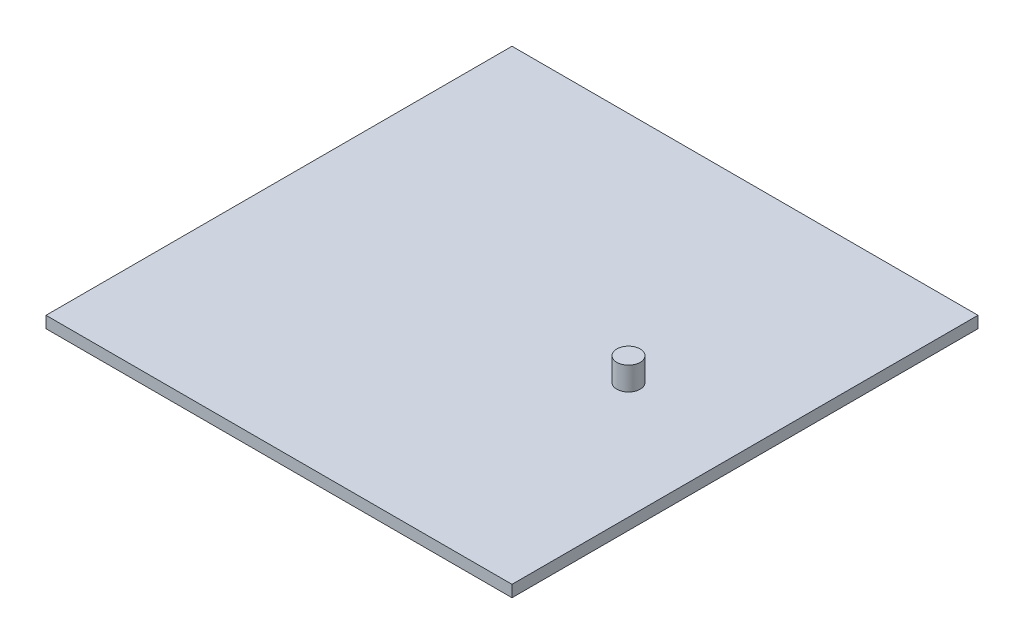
ISO-10303-21;
HEADER;
FILE_DESCRIPTION(('STEP AP214'),'2;1');
FILE_NAME('part.step','',(''),(''),'','','');
FILE_SCHEMA(('AUTOMOTIVE_DESIGN { 1 0 10303 214 1 1 1 1 }'));
ENDSEC;
DATA;
#1=APPLICATION_CONTEXT('core data for automotive mechanical design processes');
#2=APPLICATION_PROTOCOL_DEFINITION('international standard','automotive_design',2000,#1);
#3=PRODUCT_CONTEXT('',#1,'mechanical');
#4=PRODUCT('Part','Part','',(#3));
#5=PRODUCT_RELATED_PRODUCT_CATEGORY('part','',(#4));
#6=PRODUCT_DEFINITION_FORMATION('','',#4);
#7=PRODUCT_DEFINITION_CONTEXT('part definition',#1,'design');
#8=PRODUCT_DEFINITION('design','',#6,#7);
#9=PRODUCT_DEFINITION_SHAPE('','',#8);
#10=(LENGTH_UNIT() NAMED_UNIT(*) SI_UNIT(.MILLI.,.METRE.));
#11=(NAMED_UNIT(*) PLANE_ANGLE_UNIT() SI_UNIT($,.RADIAN.));
#12=(NAMED_UNIT(*) SI_UNIT($,.STERADIAN.) SOLID_ANGLE_UNIT());
#13=UNCERTAINTY_MEASURE_WITH_UNIT(LENGTH_MEASURE(1.E-05),#10,'distance_accuracy_value','');
#14=(GEOMETRIC_REPRESENTATION_CONTEXT(3) GLOBAL_UNCERTAINTY_ASSIGNED_CONTEXT((#13)) GLOBAL_UNIT_ASSIGNED_CONTEXT((#10,
#11,#12)) REPRESENTATION_CONTEXT('',''));
#15=CARTESIAN_POINT('',(0.,0.,0.));
#16=DIRECTION('',(0.,0.,1.));
#17=DIRECTION('',(1.,0.,0.));
#18=AXIS2_PLACEMENT_3D('',#15,#16,#17);
#19=CARTESIAN_POINT('',(0.,5.,0.));
#20=DIRECTION('',(0.,-1.,0.));
#21=DIRECTION('',(0.,0.,-1.));
#22=AXIS2_PLACEMENT_3D('',#19,#20,#21);
#23=PLANE('',#22);
#24=DIRECTION('',(0.,0.,1.));
#25=VECTOR('',#24,1.);
#26=CARTESIAN_POINT('',(0.,5.,0.));
#27=LINE('',#26,#25);
#28=CARTESIAN_POINT('',(0.,5.,-200.));
#29=VERTEX_POINT('',#28);
#30=CARTESIAN_POINT('',(0.,5.,0.));
#31=VERTEX_POINT('',#30);
#32=EDGE_CURVE('E86',#29,#31,#27,.T.);
#33=ORIENTED_EDGE('',*,*,#32,.T.);
#34=DIRECTION('',(1.,0.,0.));
#35=VECTOR('',#34,1.);
#36=CARTESIAN_POINT('',(0.,5.,0.));
#37=LINE('',#36,#35);
#38=CARTESIAN_POINT('',(200.,5.,0.));
#39=VERTEX_POINT('',#38);
#40=EDGE_CURVE('E81',#31,#39,#37,.T.);
#41=ORIENTED_EDGE('',*,*,#40,.T.);
#42=DIRECTION('',(0.,0.,-1.));
#43=VECTOR('',#42,1.);
#44=CARTESIAN_POINT('',(200.,5.,0.));
#45=LINE('',#44,#43);
#46=CARTESIAN_POINT('',(200.,5.,-200.));
#47=VERTEX_POINT('',#46);
#48=EDGE_CURVE('E84',#39,#47,#45,.T.);
#49=ORIENTED_EDGE('',*,*,#48,.T.);
#50=DIRECTION('',(-1.,0.,0.));
#51=VECTOR('',#50,1.);
#52=CARTESIAN_POINT('',(0.,5.,-200.));
#53=LINE('',#52,#51);
#54=EDGE_CURVE('E50',#47,#29,#53,.T.);
#55=ORIENTED_EDGE('',*,*,#54,.T.);
#56=EDGE_LOOP('',(#33,#41,#49,#55));
#57=FACE_BOUND('',#56,.T.);
#58=CARTESIAN_POINT('',(150.,5.,-100.));
#59=DIRECTION('',(0.,-1.,0.));
#60=DIRECTION('',(0.,0.,-1.));
#61=AXIS2_PLACEMENT_3D('',#58,#59,#60);
#62=CIRCLE('',#61,4.99999999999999);
#63=CARTESIAN_POINT('',(150.,5.,-105.));
#64=VERTEX_POINT('',#63);
#65=EDGE_CURVE('E11',#64,#64,#62,.F.);
#66=ORIENTED_EDGE('',*,*,#65,.F.);
#67=EDGE_LOOP('',(#66));
#68=FACE_BOUND('',#67,.T.);
#69=ADVANCED_FACE('F33',(#57,#68),#23,.F.);
#70=CARTESIAN_POINT('',(0.,5.,0.));
#71=DIRECTION('',(1.,0.,0.));
#72=DIRECTION('',(0.,0.,-1.));
#73=AXIS2_PLACEMENT_3D('',#70,#71,#72);
#74=PLANE('',#73);
#75=DIRECTION('',(0.,0.,1.));
#76=VECTOR('',#75,1.);
#77=CARTESIAN_POINT('',(0.,0.,0.));
#78=LINE('',#77,#76);
#79=CARTESIAN_POINT('',(0.,0.,-200.));
#80=VERTEX_POINT('',#79);
#81=CARTESIAN_POINT('',(0.,0.,0.));
#82=VERTEX_POINT('',#81);
#83=EDGE_CURVE('E100',#80,#82,#78,.T.);
#84=ORIENTED_EDGE('',*,*,#83,.T.);
#85=DIRECTION('',(0.,-1.,0.));
#86=VECTOR('',#85,1.);
#87=CARTESIAN_POINT('',(0.,5.,0.));
#88=LINE('',#87,#86);
#89=EDGE_CURVE('E42',#31,#82,#88,.T.);
#90=ORIENTED_EDGE('',*,*,#89,.F.);
#91=ORIENTED_EDGE('',*,*,#32,.F.);
#92=DIRECTION('',(0.,-1.,0.));
#93=VECTOR('',#92,1.);
#94=CARTESIAN_POINT('',(0.,5.,-200.));
#95=LINE('',#94,#93);
#96=EDGE_CURVE('E96',#29,#80,#95,.T.);
#97=ORIENTED_EDGE('',*,*,#96,.T.);
#98=EDGE_LOOP('',(#84,#90,#91,#97));
#99=FACE_BOUND('',#98,.T.);
#100=ADVANCED_FACE('F35',(#99),#74,.F.);
#101=CARTESIAN_POINT('',(0.,5.,0.));
#102=DIRECTION('',(0.,0.,-1.));
#103=DIRECTION('',(-1.,0.,0.));
#104=AXIS2_PLACEMENT_3D('',#101,#102,#103);
#105=PLANE('',#104);
#106=DIRECTION('',(1.,0.,0.));
#107=VECTOR('',#106,1.);
#108=CARTESIAN_POINT('',(0.,0.,0.));
#109=LINE('',#108,#107);
#110=CARTESIAN_POINT('',(200.,0.,0.));
#111=VERTEX_POINT('',#110);
#112=EDGE_CURVE('E91',#82,#111,#109,.T.);
#113=ORIENTED_EDGE('',*,*,#112,.T.);
#114=DIRECTION('',(0.,-1.,0.));
#115=VECTOR('',#114,1.);
#116=CARTESIAN_POINT('',(200.,5.,0.));
#117=LINE('',#116,#115);
#118=EDGE_CURVE('E89',#39,#111,#117,.T.);
#119=ORIENTED_EDGE('',*,*,#118,.F.);
#120=ORIENTED_EDGE('',*,*,#40,.F.);
#121=ORIENTED_EDGE('',*,*,#89,.T.);
#122=EDGE_LOOP('',(#113,#119,#120,#121));
#123=FACE_BOUND('',#122,.T.);
#124=ADVANCED_FACE('F90',(#123),#105,.F.);
#125=CARTESIAN_POINT('',(200.,5.,0.));
#126=DIRECTION('',(-1.,0.,0.));
#127=DIRECTION('',(0.,0.,1.));
#128=AXIS2_PLACEMENT_3D('',#125,#126,#127);
#129=PLANE('',#128);
#130=DIRECTION('',(0.,0.,-1.));
#131=VECTOR('',#130,1.);
#132=CARTESIAN_POINT('',(200.,0.,0.));
#133=LINE('',#132,#131);
#134=CARTESIAN_POINT('',(200.,0.,-200.));
#135=VERTEX_POINT('',#134);
#136=EDGE_CURVE('E67',#111,#135,#133,.T.);
#137=ORIENTED_EDGE('',*,*,#136,.T.);
#138=DIRECTION('',(0.,-1.,0.));
#139=VECTOR('',#138,1.);
#140=CARTESIAN_POINT('',(200.,5.,-200.));
#141=LINE('',#140,#139);
#142=EDGE_CURVE('E92',#47,#135,#141,.T.);
#143=ORIENTED_EDGE('',*,*,#142,.F.);
#144=ORIENTED_EDGE('',*,*,#48,.F.);
#145=ORIENTED_EDGE('',*,*,#118,.T.);
#146=EDGE_LOOP('',(#137,#143,#144,#145));
#147=FACE_BOUND('',#146,.T.);
#148=ADVANCED_FACE('F94',(#147),#129,.F.);
#149=CARTESIAN_POINT('',(0.,5.,-200.));
#150=DIRECTION('',(0.,0.,1.));
#151=DIRECTION('',(1.,0.,0.));
#152=AXIS2_PLACEMENT_3D('',#149,#150,#151);
#153=PLANE('',#152);
#154=DIRECTION('',(-1.,0.,0.));
#155=VECTOR('',#154,1.);
#156=CARTESIAN_POINT('',(0.,0.,-200.));
#157=LINE('',#156,#155);
#158=EDGE_CURVE('E73',#135,#80,#157,.T.);
#159=ORIENTED_EDGE('',*,*,#158,.T.);
#160=ORIENTED_EDGE('',*,*,#96,.F.);
#161=ORIENTED_EDGE('',*,*,#54,.F.);
#162=ORIENTED_EDGE('',*,*,#142,.T.);
#163=EDGE_LOOP('',(#159,#160,#161,#162));
#164=FACE_BOUND('',#163,.T.);
#165=ADVANCED_FACE('F114',(#164),#153,.F.);
#166=CARTESIAN_POINT('',(0.,0.,0.));
#167=DIRECTION('',(0.,-1.,0.));
#168=DIRECTION('',(0.,0.,-1.));
#169=AXIS2_PLACEMENT_3D('',#166,#167,#168);
#170=PLANE('',#169);
#171=ORIENTED_EDGE('',*,*,#83,.F.);
#172=ORIENTED_EDGE('',*,*,#158,.F.);
#173=ORIENTED_EDGE('',*,*,#136,.F.);
#174=ORIENTED_EDGE('',*,*,#112,.F.);
#175=EDGE_LOOP('',(#171,#172,#173,#174));
#176=FACE_BOUND('',#175,.T.);
#177=ADVANCED_FACE('F111',(#176),#170,.T.);
#178=CARTESIAN_POINT('',(150.,15.,-100.));
#179=DIRECTION('',(0.,-1.,0.));
#180=DIRECTION('',(0.,0.,-1.));
#181=AXIS2_PLACEMENT_3D('',#178,#179,#180);
#182=CYLINDRICAL_SURFACE('',#181,4.99999999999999);
#183=CARTESIAN_POINT('',(150.,15.,-100.));
#184=DIRECTION('',(0.,1.,0.));
#185=DIRECTION('',(0.,0.,1.));
#186=AXIS2_PLACEMENT_3D('',#183,#184,#185);
#187=CIRCLE('',#186,4.99999999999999);
#188=CARTESIAN_POINT('',(150.,15.,-95.));
#189=VERTEX_POINT('',#188);
#190=EDGE_CURVE('E103',#189,#189,#187,.T.);
#191=ORIENTED_EDGE('',*,*,#190,.F.);
#192=EDGE_LOOP('',(#191));
#193=FACE_BOUND('',#192,.T.);
#194=ORIENTED_EDGE('',*,*,#65,.T.);
#195=EDGE_LOOP('',(#194));
#196=FACE_BOUND('',#195,.T.);
#197=ADVANCED_FACE('F113',(#193,#196),#182,.T.);
#198=CARTESIAN_POINT('',(150.,15.,-100.));
#199=DIRECTION('',(0.,1.,0.));
#200=DIRECTION('',(0.,0.,1.));
#201=AXIS2_PLACEMENT_3D('',#198,#199,#200);
#202=PLANE('',#201);
#203=ORIENTED_EDGE('',*,*,#190,.T.);
#204=EDGE_LOOP('',(#203));
#205=FACE_BOUND('',#204,.T.);
#206=ADVANCED_FACE('F121',(#205),#202,.T.);
#207=CLOSED_SHELL('',(#69,#100,#124,#148,#165,#177,#197,#206));
#208=MANIFOLD_SOLID_BREP('B2',#207);
#209=ADVANCED_BREP_SHAPE_REPRESENTATION('',(#18,#208),#14);
#210=SHAPE_DEFINITION_REPRESENTATION(#9,#209);
ENDSEC;
END-ISO-10303-21;
